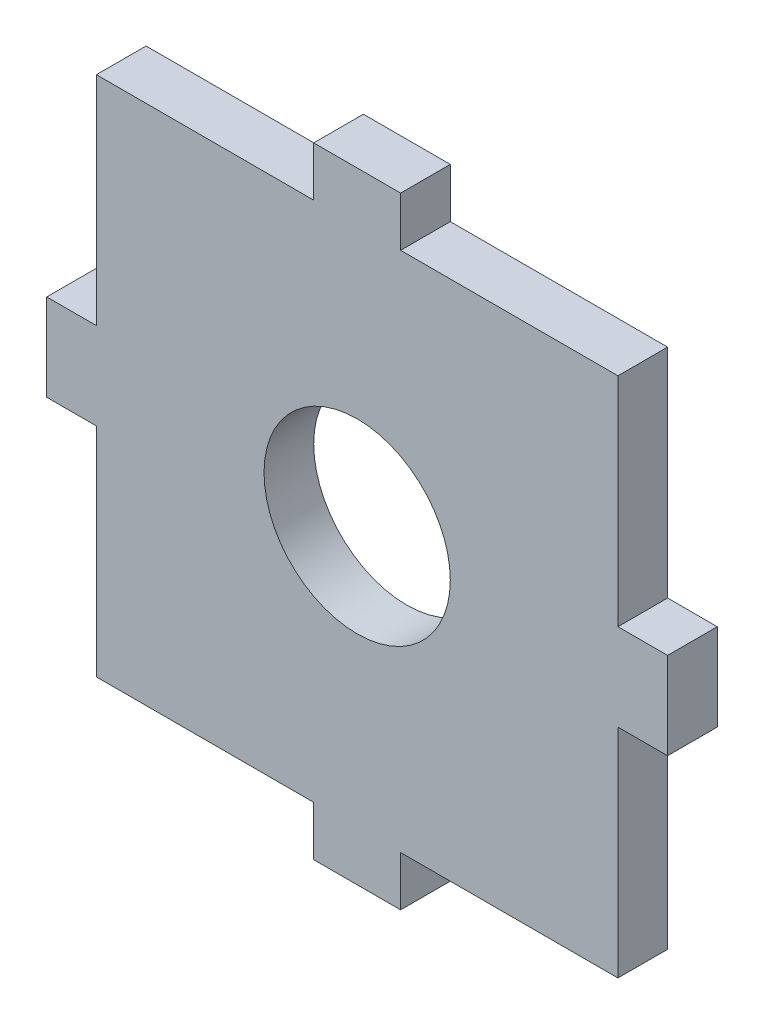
from build123d import *

# Parameters (mm, degrees)
SKETCH2_R           = 7.5
BOSS_EXTRUDE2_DEPTH = 4


with BuildPart() as part:
    # Sketch2 → Boss-Extrude2 (new body)
    with BuildSketch(Plane.XY):
        Polygon((21.361001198, -10.86470609), (17.361001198, -10.86470609), (17.361001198, 6.63529391), (-0.138998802, 6.63529391), (-0.137337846, 10.629046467), (-7.137337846, 10.629046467), (-7.137337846, 6.63529391), (-24.637337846, 6.63529391), (-24.637337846, -10.86470609), (-28.637337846, -10.86470609), (-28.637337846, -17.86470609), (-24.637337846, -17.86470609), (-24.637337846, -35.36470609), (-7.137337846, -35.36470609), (-7.137337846, -39.36470609), (-0.138998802, -39.36470609), (-0.138998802, -35.36470609), (17.361001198, -35.36470609), (17.361001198, -17.86470609), (21.361001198, -17.86470609), align=None)
        with Locations((-3.638168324, -14.36470609)):
            Circle(SKETCH2_R, mode=Mode.SUBTRACT)
    extrude(amount=BOSS_EXTRUDE2_DEPTH)


solid = part.part
